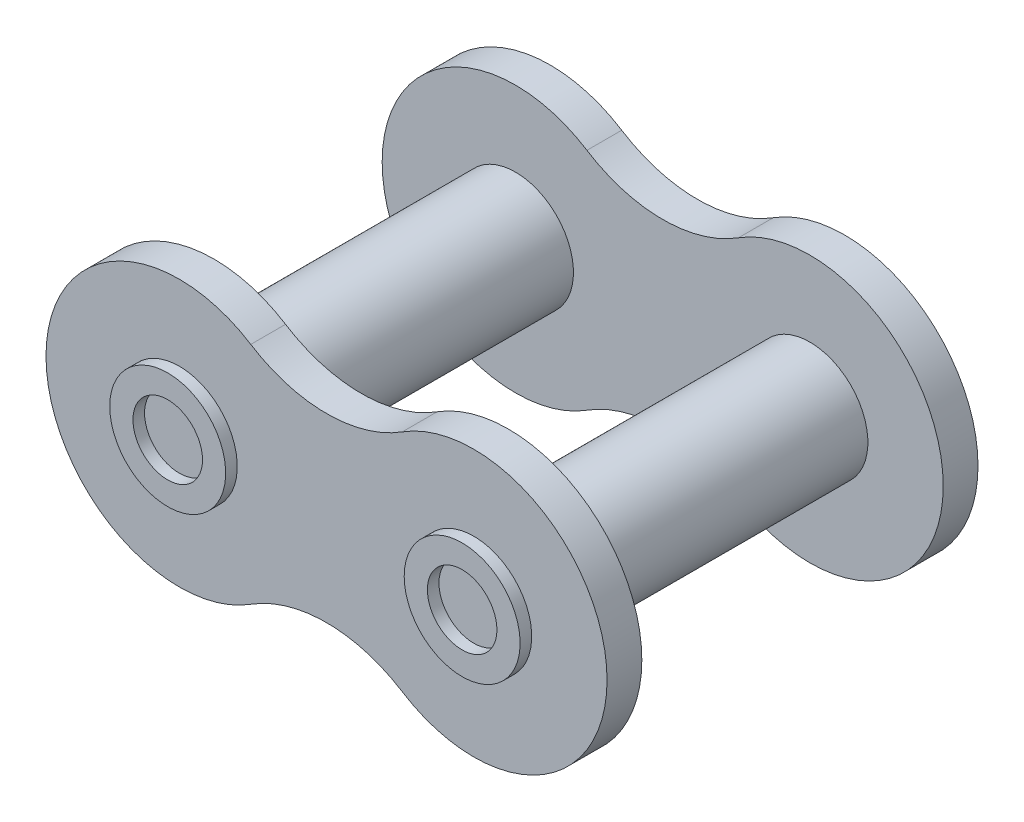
ISO-10303-21;
HEADER;
FILE_DESCRIPTION(('STEP AP214'),'2;1');
FILE_NAME('part.step','',(''),(''),'','','');
FILE_SCHEMA(('AUTOMOTIVE_DESIGN { 1 0 10303 214 1 1 1 1 }'));
ENDSEC;
DATA;
#1=APPLICATION_CONTEXT('core data for automotive mechanical design processes');
#2=APPLICATION_PROTOCOL_DEFINITION('international standard','automotive_design',2000,#1);
#3=PRODUCT_CONTEXT('',#1,'mechanical');
#4=PRODUCT('Part','Part','',(#3));
#5=PRODUCT_RELATED_PRODUCT_CATEGORY('part','',(#4));
#6=PRODUCT_DEFINITION_FORMATION('','',#4);
#7=PRODUCT_DEFINITION_CONTEXT('part definition',#1,'design');
#8=PRODUCT_DEFINITION('design','',#6,#7);
#9=PRODUCT_DEFINITION_SHAPE('','',#8);
#10=(LENGTH_UNIT() NAMED_UNIT(*) SI_UNIT(.MILLI.,.METRE.));
#11=(NAMED_UNIT(*) PLANE_ANGLE_UNIT() SI_UNIT($,.RADIAN.));
#12=(NAMED_UNIT(*) SI_UNIT($,.STERADIAN.) SOLID_ANGLE_UNIT());
#13=UNCERTAINTY_MEASURE_WITH_UNIT(LENGTH_MEASURE(1.E-05),#10,'distance_accuracy_value','');
#14=(GEOMETRIC_REPRESENTATION_CONTEXT(3) GLOBAL_UNCERTAINTY_ASSIGNED_CONTEXT((#13)) GLOBAL_UNIT_ASSIGNED_CONTEXT((#10,
#11,#12)) REPRESENTATION_CONTEXT('',''));
#15=CARTESIAN_POINT('',(0.,0.,0.));
#16=DIRECTION('',(0.,0.,1.));
#17=DIRECTION('',(1.,0.,0.));
#18=AXIS2_PLACEMENT_3D('',#15,#16,#17);
#19=CARTESIAN_POINT('',(3.175,5.,-8.));
#20=DIRECTION('',(0.,0.,1.));
#21=DIRECTION('',(1.,0.,0.));
#22=AXIS2_PLACEMENT_3D('',#19,#20,#21);
#23=PLANE('',#22);
#24=CARTESIAN_POINT('',(6.35,0.,-8.));
#25=DIRECTION('',(0.,0.,1.));
#26=DIRECTION('',(1.,0.,0.));
#27=AXIS2_PLACEMENT_3D('',#24,#25,#26);
#28=CIRCLE('',#27,2.5);
#29=CARTESIAN_POINT('',(8.85,0.,-8.));
#30=VERTEX_POINT('',#29);
#31=EDGE_CURVE('E272',#30,#30,#28,.T.);
#32=ORIENTED_EDGE('',*,*,#31,.T.);
#33=EDGE_LOOP('',(#32));
#34=FACE_BOUND('',#33,.T.);
#35=CARTESIAN_POINT('',(0.,10.,-8.));
#36=DIRECTION('',(0.,0.,1.));
#37=DIRECTION('',(1.,0.,0.));
#38=AXIS2_PLACEMENT_3D('',#35,#36,#37);
#39=CIRCLE('',#38,6.09577983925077);
#40=CARTESIAN_POINT('',(-3.26767865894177,4.85404935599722,-8.));
#41=VERTEX_POINT('',#40);
#42=CARTESIAN_POINT('',(3.26767865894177,4.85404935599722,-8.));
#43=VERTEX_POINT('',#42);
#44=EDGE_CURVE('E166',#41,#43,#39,.T.);
#45=ORIENTED_EDGE('',*,*,#44,.T.);
#46=CARTESIAN_POINT('',(6.35,0.,-8.));
#47=DIRECTION('',(0.,0.,-1.));
#48=DIRECTION('',(-1.,0.,0.));
#49=AXIS2_PLACEMENT_3D('',#46,#47,#48);
#50=CIRCLE('',#49,5.75);
#51=CARTESIAN_POINT('',(3.26767865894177,-4.85404935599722,-8.));
#52=VERTEX_POINT('',#51);
#53=EDGE_CURVE('E84',#43,#52,#50,.T.);
#54=ORIENTED_EDGE('',*,*,#53,.T.);
#55=CARTESIAN_POINT('',(0.,-10.,-8.));
#56=DIRECTION('',(0.,0.,-1.));
#57=DIRECTION('',(-1.,0.,0.));
#58=AXIS2_PLACEMENT_3D('',#55,#56,#57);
#59=CIRCLE('',#58,6.09577983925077);
#60=CARTESIAN_POINT('',(-3.26767865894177,-4.85404935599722,-8.));
#61=VERTEX_POINT('',#60);
#62=EDGE_CURVE('E170',#61,#52,#59,.T.);
#63=ORIENTED_EDGE('',*,*,#62,.F.);
#64=CARTESIAN_POINT('',(-6.35,0.,-8.));
#65=DIRECTION('',(0.,0.,1.));
#66=DIRECTION('',(1.,0.,0.));
#67=AXIS2_PLACEMENT_3D('',#64,#65,#66);
#68=CIRCLE('',#67,5.75);
#69=EDGE_CURVE('E173',#41,#61,#68,.T.);
#70=ORIENTED_EDGE('',*,*,#69,.F.);
#71=EDGE_LOOP('',(#45,#54,#63,#70));
#72=FACE_BOUND('',#71,.T.);
#73=CARTESIAN_POINT('',(-6.35,0.,-8.));
#74=DIRECTION('',(0.,0.,1.));
#75=DIRECTION('',(1.,0.,0.));
#76=AXIS2_PLACEMENT_3D('',#73,#74,#75);
#77=CIRCLE('',#76,2.5);
#78=CARTESIAN_POINT('',(-3.85,0.,-8.));
#79=VERTEX_POINT('',#78);
#80=EDGE_CURVE('E12',#79,#79,#77,.F.);
#81=ORIENTED_EDGE('',*,*,#80,.F.);
#82=EDGE_LOOP('',(#81));
#83=FACE_BOUND('',#82,.T.);
#84=ADVANCED_FACE('F39',(#34,#72,#83),#23,.F.);
#85=CARTESIAN_POINT('',(3.175,5.,8.));
#86=DIRECTION('',(0.,0.,-1.));
#87=DIRECTION('',(1.,0.,0.));
#88=AXIS2_PLACEMENT_3D('',#85,#86,#87);
#89=PLANE('',#88);
#90=CARTESIAN_POINT('',(6.35,0.,8.));
#91=DIRECTION('',(0.,0.,-1.));
#92=DIRECTION('',(-1.,0.,0.));
#93=AXIS2_PLACEMENT_3D('',#90,#91,#92);
#94=CIRCLE('',#93,2.5);
#95=CARTESIAN_POINT('',(3.85,0.,8.));
#96=VERTEX_POINT('',#95);
#97=EDGE_CURVE('E276',#96,#96,#94,.T.);
#98=ORIENTED_EDGE('',*,*,#97,.T.);
#99=EDGE_LOOP('',(#98));
#100=FACE_BOUND('',#99,.T.);
#101=CARTESIAN_POINT('',(0.,10.,8.));
#102=DIRECTION('',(0.,0.,1.));
#103=DIRECTION('',(1.,0.,0.));
#104=AXIS2_PLACEMENT_3D('',#101,#102,#103);
#105=CIRCLE('',#104,6.09577983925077);
#106=CARTESIAN_POINT('',(-3.26767865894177,4.85404935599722,8.));
#107=VERTEX_POINT('',#106);
#108=CARTESIAN_POINT('',(3.26767865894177,4.85404935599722,8.));
#109=VERTEX_POINT('',#108);
#110=EDGE_CURVE('E116',#107,#109,#105,.T.);
#111=ORIENTED_EDGE('',*,*,#110,.F.);
#112=CARTESIAN_POINT('',(-6.35,0.,8.));
#113=DIRECTION('',(0.,0.,1.));
#114=DIRECTION('',(1.,0.,0.));
#115=AXIS2_PLACEMENT_3D('',#112,#113,#114);
#116=CIRCLE('',#115,5.75);
#117=CARTESIAN_POINT('',(-3.26767865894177,-4.85404935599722,8.));
#118=VERTEX_POINT('',#117);
#119=EDGE_CURVE('E126',#107,#118,#116,.T.);
#120=ORIENTED_EDGE('',*,*,#119,.T.);
#121=CARTESIAN_POINT('',(0.,-10.,8.));
#122=DIRECTION('',(0.,0.,-1.));
#123=DIRECTION('',(-1.,0.,0.));
#124=AXIS2_PLACEMENT_3D('',#121,#122,#123);
#125=CIRCLE('',#124,6.09577983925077);
#126=CARTESIAN_POINT('',(3.26767865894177,-4.85404935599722,8.));
#127=VERTEX_POINT('',#126);
#128=EDGE_CURVE('E131',#118,#127,#125,.T.);
#129=ORIENTED_EDGE('',*,*,#128,.T.);
#130=CARTESIAN_POINT('',(6.35,0.,8.));
#131=DIRECTION('',(0.,0.,-1.));
#132=DIRECTION('',(-1.,0.,0.));
#133=AXIS2_PLACEMENT_3D('',#130,#131,#132);
#134=CIRCLE('',#133,5.75);
#135=EDGE_CURVE('E136',#109,#127,#134,.T.);
#136=ORIENTED_EDGE('',*,*,#135,.F.);
#137=EDGE_LOOP('',(#111,#120,#129,#136));
#138=FACE_BOUND('',#137,.T.);
#139=CARTESIAN_POINT('',(-6.35,0.,8.));
#140=DIRECTION('',(0.,0.,-1.));
#141=DIRECTION('',(-1.,0.,0.));
#142=AXIS2_PLACEMENT_3D('',#139,#140,#141);
#143=CIRCLE('',#142,2.5);
#144=CARTESIAN_POINT('',(-8.85,0.,8.));
#145=VERTEX_POINT('',#144);
#146=EDGE_CURVE('E43',#145,#145,#143,.F.);
#147=ORIENTED_EDGE('',*,*,#146,.F.);
#148=EDGE_LOOP('',(#147));
#149=FACE_BOUND('',#148,.T.);
#150=ADVANCED_FACE('F133',(#100,#138,#149),#89,.F.);
#151=CARTESIAN_POINT('',(3.175,5.,-6.5));
#152=DIRECTION('',(0.,0.,1.));
#153=DIRECTION('',(1.,0.,0.));
#154=AXIS2_PLACEMENT_3D('',#151,#152,#153);
#155=PLANE('',#154);
#156=CARTESIAN_POINT('',(0.,10.,-6.5));
#157=DIRECTION('',(0.,0.,1.));
#158=DIRECTION('',(1.,0.,0.));
#159=AXIS2_PLACEMENT_3D('',#156,#157,#158);
#160=CIRCLE('',#159,6.09577983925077);
#161=CARTESIAN_POINT('',(-3.26767865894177,4.85404935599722,-6.5));
#162=VERTEX_POINT('',#161);
#163=CARTESIAN_POINT('',(3.26767865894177,4.85404935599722,-6.5));
#164=VERTEX_POINT('',#163);
#165=EDGE_CURVE('E163',#162,#164,#160,.T.);
#166=ORIENTED_EDGE('',*,*,#165,.F.);
#167=CARTESIAN_POINT('',(-6.35,0.,-6.5));
#168=DIRECTION('',(0.,0.,1.));
#169=DIRECTION('',(1.,0.,0.));
#170=AXIS2_PLACEMENT_3D('',#167,#168,#169);
#171=CIRCLE('',#170,5.75);
#172=CARTESIAN_POINT('',(-3.26767865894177,-4.85404935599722,-6.5));
#173=VERTEX_POINT('',#172);
#174=EDGE_CURVE('E168',#162,#173,#171,.T.);
#175=ORIENTED_EDGE('',*,*,#174,.T.);
#176=CARTESIAN_POINT('',(0.,-10.,-6.5));
#177=DIRECTION('',(0.,0.,-1.));
#178=DIRECTION('',(-1.,0.,0.));
#179=AXIS2_PLACEMENT_3D('',#176,#177,#178);
#180=CIRCLE('',#179,6.09577983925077);
#181=CARTESIAN_POINT('',(3.26767865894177,-4.85404935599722,-6.5));
#182=VERTEX_POINT('',#181);
#183=EDGE_CURVE('E179',#173,#182,#180,.T.);
#184=ORIENTED_EDGE('',*,*,#183,.T.);
#185=CARTESIAN_POINT('',(6.35,0.,-6.5));
#186=DIRECTION('',(0.,0.,-1.));
#187=DIRECTION('',(-1.,0.,0.));
#188=AXIS2_PLACEMENT_3D('',#185,#186,#187);
#189=CIRCLE('',#188,5.75);
#190=EDGE_CURVE('E176',#164,#182,#189,.T.);
#191=ORIENTED_EDGE('',*,*,#190,.F.);
#192=EDGE_LOOP('',(#166,#175,#184,#191));
#193=FACE_BOUND('',#192,.T.);
#194=CARTESIAN_POINT('',(6.35,0.,-6.5));
#195=DIRECTION('',(0.,0.,1.));
#196=DIRECTION('',(1.,0.,0.));
#197=AXIS2_PLACEMENT_3D('',#194,#195,#196);
#198=CIRCLE('',#197,2.5);
#199=CARTESIAN_POINT('',(3.85,0.,-6.5));
#200=VERTEX_POINT('',#199);
#201=EDGE_CURVE('E189',#200,#200,#198,.F.);
#202=ORIENTED_EDGE('',*,*,#201,.T.);
#203=EDGE_LOOP('',(#202));
#204=FACE_BOUND('',#203,.T.);
#205=CARTESIAN_POINT('',(-6.35,0.,-6.5));
#206=DIRECTION('',(0.,0.,1.));
#207=DIRECTION('',(1.,0.,0.));
#208=AXIS2_PLACEMENT_3D('',#205,#206,#207);
#209=CIRCLE('',#208,2.5);
#210=CARTESIAN_POINT('',(-8.85,0.,-6.5));
#211=VERTEX_POINT('',#210);
#212=EDGE_CURVE('E160',#211,#211,#209,.T.);
#213=ORIENTED_EDGE('',*,*,#212,.F.);
#214=EDGE_LOOP('',(#213));
#215=FACE_BOUND('',#214,.T.);
#216=ADVANCED_FACE('F198',(#193,#204,#215),#155,.T.);
#217=CARTESIAN_POINT('',(6.35,0.,6.5));
#218=DIRECTION('',(0.,0.,-1.));
#219=DIRECTION('',(-1.,0.,0.));
#220=AXIS2_PLACEMENT_3D('',#217,#218,#219);
#221=CYLINDRICAL_SURFACE('',#220,2.5);
#222=CARTESIAN_POINT('',(6.35,0.,6.5));
#223=DIRECTION('',(0.,0.,-1.));
#224=DIRECTION('',(-1.,0.,0.));
#225=AXIS2_PLACEMENT_3D('',#222,#223,#224);
#226=CIRCLE('',#225,2.5);
#227=CARTESIAN_POINT('',(3.85,0.,6.5));
#228=VERTEX_POINT('',#227);
#229=EDGE_CURVE('E122',#228,#228,#226,.F.);
#230=CARTESIAN_POINT('',(3.85,0.,6.5));
#231=CARTESIAN_POINT('',(3.85,0.,6.36458333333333));
#232=CARTESIAN_POINT('',(3.85,0.,6.22916666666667));
#233=CARTESIAN_POINT('',(3.85,0.,5.95833333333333));
#234=CARTESIAN_POINT('',(3.85,0.,5.82291666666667));
#235=CARTESIAN_POINT('',(3.85,0.,5.55208333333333));
#236=CARTESIAN_POINT('',(3.85,0.,5.41666666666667));
#237=CARTESIAN_POINT('',(3.85,0.,5.14583333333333));
#238=CARTESIAN_POINT('',(3.85,0.,5.01041666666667));
#239=CARTESIAN_POINT('',(3.85,0.,4.73958333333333));
#240=CARTESIAN_POINT('',(3.85,0.,4.60416666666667));
#241=CARTESIAN_POINT('',(3.85,0.,4.33333333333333));
#242=CARTESIAN_POINT('',(3.85,0.,4.19791666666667));
#243=CARTESIAN_POINT('',(3.85,0.,3.92708333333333));
#244=CARTESIAN_POINT('',(3.85,0.,3.79166666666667));
#245=CARTESIAN_POINT('',(3.85,0.,3.52083333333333));
#246=CARTESIAN_POINT('',(3.85,0.,3.38541666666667));
#247=CARTESIAN_POINT('',(3.85,0.,3.11458333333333));
#248=CARTESIAN_POINT('',(3.85,0.,2.97916666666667));
#249=CARTESIAN_POINT('',(3.85,0.,2.70833333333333));
#250=CARTESIAN_POINT('',(3.85,0.,2.57291666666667));
#251=CARTESIAN_POINT('',(3.85,0.,2.30208333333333));
#252=CARTESIAN_POINT('',(3.85,0.,2.16666666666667));
#253=CARTESIAN_POINT('',(3.85,0.,1.89583333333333));
#254=CARTESIAN_POINT('',(3.85,0.,1.76041666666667));
#255=CARTESIAN_POINT('',(3.85,0.,1.48958333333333));
#256=CARTESIAN_POINT('',(3.85,0.,1.35416666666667));
#257=CARTESIAN_POINT('',(3.85,0.,1.08333333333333));
#258=CARTESIAN_POINT('',(3.85,0.,0.947916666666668));
#259=CARTESIAN_POINT('',(3.85,0.,0.677083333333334));
#260=CARTESIAN_POINT('',(3.85,0.,0.541666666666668));
#261=CARTESIAN_POINT('',(3.85,0.,0.270833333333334));
#262=CARTESIAN_POINT('',(3.85,0.,0.135416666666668));
#263=CARTESIAN_POINT('',(3.85,0.,-0.135416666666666));
#264=CARTESIAN_POINT('',(3.85,0.,-0.270833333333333));
#265=CARTESIAN_POINT('',(3.85,0.,-0.541666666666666));
#266=CARTESIAN_POINT('',(3.85,0.,-0.677083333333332));
#267=CARTESIAN_POINT('',(3.85,0.,-0.947916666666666));
#268=CARTESIAN_POINT('',(3.85,0.,-1.08333333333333));
#269=CARTESIAN_POINT('',(3.85,0.,-1.35416666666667));
#270=CARTESIAN_POINT('',(3.85,0.,-1.48958333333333));
#271=CARTESIAN_POINT('',(3.85,0.,-1.76041666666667));
#272=CARTESIAN_POINT('',(3.85,0.,-1.89583333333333));
#273=CARTESIAN_POINT('',(3.85,0.,-2.16666666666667));
#274=CARTESIAN_POINT('',(3.85,0.,-2.30208333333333));
#275=CARTESIAN_POINT('',(3.85,0.,-2.57291666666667));
#276=CARTESIAN_POINT('',(3.85,0.,-2.70833333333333));
#277=CARTESIAN_POINT('',(3.85,0.,-2.97916666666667));
#278=CARTESIAN_POINT('',(3.85,0.,-3.11458333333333));
#279=CARTESIAN_POINT('',(3.85,0.,-3.38541666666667));
#280=CARTESIAN_POINT('',(3.85,0.,-3.52083333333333));
#281=CARTESIAN_POINT('',(3.85,0.,-3.79166666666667));
#282=CARTESIAN_POINT('',(3.85,0.,-3.92708333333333));
#283=CARTESIAN_POINT('',(3.85,0.,-4.19791666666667));
#284=CARTESIAN_POINT('',(3.85,0.,-4.33333333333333));
#285=CARTESIAN_POINT('',(3.85,0.,-4.60416666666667));
#286=CARTESIAN_POINT('',(3.85,0.,-4.73958333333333));
#287=CARTESIAN_POINT('',(3.85,0.,-5.01041666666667));
#288=CARTESIAN_POINT('',(3.85,0.,-5.14583333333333));
#289=CARTESIAN_POINT('',(3.85,0.,-5.41666666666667));
#290=CARTESIAN_POINT('',(3.85,0.,-5.55208333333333));
#291=CARTESIAN_POINT('',(3.85,0.,-5.82291666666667));
#292=CARTESIAN_POINT('',(3.85,0.,-5.95833333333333));
#293=CARTESIAN_POINT('',(3.85,0.,-6.22916666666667));
#294=CARTESIAN_POINT('',(3.85,0.,-6.36458333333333));
#295=CARTESIAN_POINT('',(3.85,0.,-6.5));
#296=B_SPLINE_CURVE_WITH_KNOTS('',3,(#230,#231,#232,#233,#234,#235,#236,#237,#238,#239,#240,
#241,#242,#243,#244,#245,#246,#247,#248,#249,#250,#251,#252,#253,#254,#255,#256,#257,#258,#259,
#260,#261,#262,#263,#264,#265,#266,#267,#268,#269,#270,#271,#272,#273,#274,#275,#276,#277,#278,
#279,#280,#281,#282,#283,#284,#285,#286,#287,#288,#289,#290,#291,#292,#293,#294,#295),
.UNSPECIFIED.,.F.,.F.,(4,2,2,2,2,2,2,2,2,2,2,2,2,2,2,2,2,2,2,2,2,2,2,2,2,2,2,2,2,2,2,2,4),(0.,
0.40625,0.812500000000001,1.21875,1.625,2.03125,2.4375,2.84375,3.25,3.65625,4.0625,4.46875,
4.875,5.28125,5.6875,6.09375,6.5,6.90625,7.3125,7.71875,8.125,8.53125,8.9375,9.34375,9.75,
10.15625,10.5625,10.96875,11.375,11.78125,12.1875,12.59375,13.),.UNSPECIFIED.);
#297=EDGE_CURVE('BSEAM41',#228,#200,#296,.T.);
#298=ORIENTED_EDGE('',*,*,#229,.F.);
#299=ORIENTED_EDGE('',*,*,#201,.F.);
#300=ORIENTED_EDGE('',*,*,#297,.T.);
#301=ORIENTED_EDGE('',*,*,#297,.F.);
#302=EDGE_LOOP('',(#298,#300,#299,#301));
#303=FACE_BOUND('',#302,.T.);
#304=ADVANCED_FACE('F41',(#303),#221,.T.);
#305=CARTESIAN_POINT('',(0.,10.,-8.));
#306=DIRECTION('',(0.,0.,1.));
#307=DIRECTION('',(1.,0.,0.));
#308=AXIS2_PLACEMENT_3D('',#305,#306,#307);
#309=CYLINDRICAL_SURFACE('',#308,6.09577983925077);
#310=ORIENTED_EDGE('',*,*,#165,.T.);
#311=DIRECTION('',(0.,0.,1.));
#312=VECTOR('',#311,1.);
#313=CARTESIAN_POINT('',(3.26767865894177,4.85404935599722,-8.));
#314=LINE('',#313,#312);
#315=EDGE_CURVE('E188',#43,#164,#314,.T.);
#316=ORIENTED_EDGE('',*,*,#315,.F.);
#317=ORIENTED_EDGE('',*,*,#44,.F.);
#318=DIRECTION('',(0.,0.,1.));
#319=VECTOR('',#318,1.);
#320=CARTESIAN_POINT('',(-3.26767865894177,4.85404935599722,-8.));
#321=LINE('',#320,#319);
#322=EDGE_CURVE('E57',#41,#162,#321,.T.);
#323=ORIENTED_EDGE('',*,*,#322,.T.);
#324=EDGE_LOOP('',(#310,#316,#317,#323));
#325=FACE_BOUND('',#324,.T.);
#326=ADVANCED_FACE('F244',(#325),#309,.F.);
#327=CARTESIAN_POINT('',(6.35,0.,-8.));
#328=DIRECTION('',(0.,0.,1.));
#329=DIRECTION('',(1.,0.,0.));
#330=AXIS2_PLACEMENT_3D('',#327,#328,#329);
#331=CYLINDRICAL_SURFACE('',#330,5.75);
#332=ORIENTED_EDGE('',*,*,#190,.T.);
#333=DIRECTION('',(0.,0.,1.));
#334=VECTOR('',#333,1.);
#335=CARTESIAN_POINT('',(3.26767865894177,-4.85404935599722,-8.));
#336=LINE('',#335,#334);
#337=EDGE_CURVE('E186',#52,#182,#336,.T.);
#338=ORIENTED_EDGE('',*,*,#337,.F.);
#339=ORIENTED_EDGE('',*,*,#53,.F.);
#340=ORIENTED_EDGE('',*,*,#315,.T.);
#341=EDGE_LOOP('',(#332,#338,#339,#340));
#342=FACE_BOUND('',#341,.T.);
#343=ADVANCED_FACE('F241',(#342),#331,.T.);
#344=CARTESIAN_POINT('',(0.,-10.,-8.));
#345=DIRECTION('',(0.,0.,1.));
#346=DIRECTION('',(1.,0.,0.));
#347=AXIS2_PLACEMENT_3D('',#344,#345,#346);
#348=CYLINDRICAL_SURFACE('',#347,6.09577983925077);
#349=ORIENTED_EDGE('',*,*,#183,.F.);
#350=DIRECTION('',(0.,0.,1.));
#351=VECTOR('',#350,1.);
#352=CARTESIAN_POINT('',(-3.26767865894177,-4.85404935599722,-8.));
#353=LINE('',#352,#351);
#354=EDGE_CURVE('E72',#61,#173,#353,.T.);
#355=ORIENTED_EDGE('',*,*,#354,.F.);
#356=ORIENTED_EDGE('',*,*,#62,.T.);
#357=ORIENTED_EDGE('',*,*,#337,.T.);
#358=EDGE_LOOP('',(#349,#355,#356,#357));
#359=FACE_BOUND('',#358,.T.);
#360=ADVANCED_FACE('F238',(#359),#348,.F.);
#361=CARTESIAN_POINT('',(-6.35,0.,-8.));
#362=DIRECTION('',(0.,0.,1.));
#363=DIRECTION('',(1.,0.,0.));
#364=AXIS2_PLACEMENT_3D('',#361,#362,#363);
#365=CYLINDRICAL_SURFACE('',#364,5.75);
#366=ORIENTED_EDGE('',*,*,#174,.F.);
#367=ORIENTED_EDGE('',*,*,#322,.F.);
#368=ORIENTED_EDGE('',*,*,#69,.T.);
#369=ORIENTED_EDGE('',*,*,#354,.T.);
#370=EDGE_LOOP('',(#366,#367,#368,#369));
#371=FACE_BOUND('',#370,.T.);
#372=ADVANCED_FACE('F233',(#371),#365,.T.);
#373=CARTESIAN_POINT('',(-6.35,0.,6.5));
#374=DIRECTION('',(0.,0.,-1.));
#375=DIRECTION('',(-1.,0.,0.));
#376=AXIS2_PLACEMENT_3D('',#373,#374,#375);
#377=CYLINDRICAL_SURFACE('',#376,2.5);
#378=CARTESIAN_POINT('',(-6.35,0.,6.5));
#379=DIRECTION('',(0.,0.,1.));
#380=DIRECTION('',(1.,0.,0.));
#381=AXIS2_PLACEMENT_3D('',#378,#379,#380);
#382=CIRCLE('',#381,2.5);
#383=CARTESIAN_POINT('',(-8.85,0.,6.5));
#384=VERTEX_POINT('',#383);
#385=EDGE_CURVE('E159',#384,#384,#382,.T.);
#386=CARTESIAN_POINT('',(-8.85,0.,6.5));
#387=CARTESIAN_POINT('',(-8.85,0.,6.36458333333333));
#388=CARTESIAN_POINT('',(-8.85,0.,6.22916666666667));
#389=CARTESIAN_POINT('',(-8.85,0.,5.95833333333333));
#390=CARTESIAN_POINT('',(-8.85,0.,5.82291666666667));
#391=CARTESIAN_POINT('',(-8.85,0.,5.55208333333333));
#392=CARTESIAN_POINT('',(-8.85,0.,5.41666666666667));
#393=CARTESIAN_POINT('',(-8.85,0.,5.14583333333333));
#394=CARTESIAN_POINT('',(-8.85,0.,5.01041666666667));
#395=CARTESIAN_POINT('',(-8.85,0.,4.73958333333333));
#396=CARTESIAN_POINT('',(-8.85,0.,4.60416666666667));
#397=CARTESIAN_POINT('',(-8.85,0.,4.33333333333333));
#398=CARTESIAN_POINT('',(-8.85,0.,4.19791666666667));
#399=CARTESIAN_POINT('',(-8.85,0.,3.92708333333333));
#400=CARTESIAN_POINT('',(-8.85,0.,3.79166666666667));
#401=CARTESIAN_POINT('',(-8.85,0.,3.52083333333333));
#402=CARTESIAN_POINT('',(-8.85,0.,3.38541666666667));
#403=CARTESIAN_POINT('',(-8.85,0.,3.11458333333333));
#404=CARTESIAN_POINT('',(-8.85,0.,2.97916666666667));
#405=CARTESIAN_POINT('',(-8.85,0.,2.70833333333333));
#406=CARTESIAN_POINT('',(-8.85,0.,2.57291666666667));
#407=CARTESIAN_POINT('',(-8.85,0.,2.30208333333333));
#408=CARTESIAN_POINT('',(-8.85,0.,2.16666666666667));
#409=CARTESIAN_POINT('',(-8.85,0.,1.89583333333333));
#410=CARTESIAN_POINT('',(-8.85,0.,1.76041666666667));
#411=CARTESIAN_POINT('',(-8.85,0.,1.48958333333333));
#412=CARTESIAN_POINT('',(-8.85,0.,1.35416666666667));
#413=CARTESIAN_POINT('',(-8.85,0.,1.08333333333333));
#414=CARTESIAN_POINT('',(-8.85,0.,0.947916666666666));
#415=CARTESIAN_POINT('',(-8.85,0.,0.677083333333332));
#416=CARTESIAN_POINT('',(-8.85,0.,0.541666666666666));
#417=CARTESIAN_POINT('',(-8.85,0.,0.270833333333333));
#418=CARTESIAN_POINT('',(-8.85,0.,0.135416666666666));
#419=CARTESIAN_POINT('',(-8.85,0.,-0.135416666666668));
#420=CARTESIAN_POINT('',(-8.85,0.,-0.270833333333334));
#421=CARTESIAN_POINT('',(-8.85,0.,-0.541666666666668));
#422=CARTESIAN_POINT('',(-8.85,0.,-0.677083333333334));
#423=CARTESIAN_POINT('',(-8.85,0.,-0.947916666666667));
#424=CARTESIAN_POINT('',(-8.85,0.,-1.08333333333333));
#425=CARTESIAN_POINT('',(-8.85,0.,-1.35416666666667));
#426=CARTESIAN_POINT('',(-8.85,0.,-1.48958333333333));
#427=CARTESIAN_POINT('',(-8.85,0.,-1.76041666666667));
#428=CARTESIAN_POINT('',(-8.85,0.,-1.89583333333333));
#429=CARTESIAN_POINT('',(-8.85,0.,-2.16666666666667));
#430=CARTESIAN_POINT('',(-8.85,0.,-2.30208333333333));
#431=CARTESIAN_POINT('',(-8.85,0.,-2.57291666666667));
#432=CARTESIAN_POINT('',(-8.85,0.,-2.70833333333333));
#433=CARTESIAN_POINT('',(-8.85,0.,-2.97916666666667));
#434=CARTESIAN_POINT('',(-8.85,0.,-3.11458333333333));
#435=CARTESIAN_POINT('',(-8.85,0.,-3.38541666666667));
#436=CARTESIAN_POINT('',(-8.85,0.,-3.52083333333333));
#437=CARTESIAN_POINT('',(-8.85,0.,-3.79166666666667));
#438=CARTESIAN_POINT('',(-8.85,0.,-3.92708333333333));
#439=CARTESIAN_POINT('',(-8.85,0.,-4.19791666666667));
#440=CARTESIAN_POINT('',(-8.85,0.,-4.33333333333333));
#441=CARTESIAN_POINT('',(-8.85,0.,-4.60416666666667));
#442=CARTESIAN_POINT('',(-8.85,0.,-4.73958333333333));
#443=CARTESIAN_POINT('',(-8.85,0.,-5.01041666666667));
#444=CARTESIAN_POINT('',(-8.85,0.,-5.14583333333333));
#445=CARTESIAN_POINT('',(-8.85,0.,-5.41666666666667));
#446=CARTESIAN_POINT('',(-8.85,0.,-5.55208333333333));
#447=CARTESIAN_POINT('',(-8.85,0.,-5.82291666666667));
#448=CARTESIAN_POINT('',(-8.85,0.,-5.95833333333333));
#449=CARTESIAN_POINT('',(-8.85,0.,-6.22916666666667));
#450=CARTESIAN_POINT('',(-8.85,0.,-6.36458333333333));
#451=CARTESIAN_POINT('',(-8.85,0.,-6.5));
#452=B_SPLINE_CURVE_WITH_KNOTS('',3,(#386,#387,#388,#389,#390,#391,#392,#393,#394,#395,#396,
#397,#398,#399,#400,#401,#402,#403,#404,#405,#406,#407,#408,#409,#410,#411,#412,#413,#414,#415,
#416,#417,#418,#419,#420,#421,#422,#423,#424,#425,#426,#427,#428,#429,#430,#431,#432,#433,#434,
#435,#436,#437,#438,#439,#440,#441,#442,#443,#444,#445,#446,#447,#448,#449,#450,#451),
.UNSPECIFIED.,.F.,.F.,(4,2,2,2,2,2,2,2,2,2,2,2,2,2,2,2,2,2,2,2,2,2,2,2,2,2,2,2,2,2,2,2,4),(0.,
0.40625,0.8125,1.21875,1.625,2.03125,2.4375,2.84375,3.25,3.65625,4.0625,4.46875,4.875,5.28125,
5.6875,6.09375,6.5,6.90625,7.3125,7.71875,8.125,8.53125,8.9375,9.34375,9.75,10.15625,10.5625,
10.96875,11.375,11.78125,12.1875,12.59375,13.),.UNSPECIFIED.);
#453=EDGE_CURVE('BSEAM217',#384,#211,#452,.T.);
#454=ORIENTED_EDGE('',*,*,#385,.F.);
#455=ORIENTED_EDGE('',*,*,#212,.T.);
#456=ORIENTED_EDGE('',*,*,#453,.T.);
#457=ORIENTED_EDGE('',*,*,#453,.F.);
#458=EDGE_LOOP('',(#454,#456,#455,#457));
#459=FACE_BOUND('',#458,.T.);
#460=ADVANCED_FACE('F217',(#459),#377,.T.);
#461=CARTESIAN_POINT('',(3.175,5.,6.5));
#462=DIRECTION('',(0.,0.,-1.));
#463=DIRECTION('',(1.,0.,0.));
#464=AXIS2_PLACEMENT_3D('',#461,#462,#463);
#465=PLANE('',#464);
#466=ORIENTED_EDGE('',*,*,#229,.T.);
#467=EDGE_LOOP('',(#466));
#468=FACE_BOUND('',#467,.T.);
#469=CARTESIAN_POINT('',(0.,10.,6.5));
#470=DIRECTION('',(0.,0.,1.));
#471=DIRECTION('',(1.,0.,0.));
#472=AXIS2_PLACEMENT_3D('',#469,#470,#471);
#473=CIRCLE('',#472,6.09577983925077);
#474=CARTESIAN_POINT('',(-3.26767865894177,4.85404935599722,6.5));
#475=VERTEX_POINT('',#474);
#476=CARTESIAN_POINT('',(3.26767865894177,4.85404935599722,6.5));
#477=VERTEX_POINT('',#476);
#478=EDGE_CURVE('E119',#475,#477,#473,.T.);
#479=ORIENTED_EDGE('',*,*,#478,.T.);
#480=CARTESIAN_POINT('',(6.35,0.,6.5));
#481=DIRECTION('',(0.,0.,-1.));
#482=DIRECTION('',(-1.,0.,0.));
#483=AXIS2_PLACEMENT_3D('',#480,#481,#482);
#484=CIRCLE('',#483,5.75);
#485=CARTESIAN_POINT('',(3.26767865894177,-4.85404935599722,6.5));
#486=VERTEX_POINT('',#485);
#487=EDGE_CURVE('E137',#477,#486,#484,.T.);
#488=ORIENTED_EDGE('',*,*,#487,.T.);
#489=CARTESIAN_POINT('',(0.,-10.,6.5));
#490=DIRECTION('',(0.,0.,-1.));
#491=DIRECTION('',(-1.,0.,0.));
#492=AXIS2_PLACEMENT_3D('',#489,#490,#491);
#493=CIRCLE('',#492,6.09577983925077);
#494=CARTESIAN_POINT('',(-3.26767865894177,-4.85404935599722,6.5));
#495=VERTEX_POINT('',#494);
#496=EDGE_CURVE('E140',#495,#486,#493,.T.);
#497=ORIENTED_EDGE('',*,*,#496,.F.);
#498=CARTESIAN_POINT('',(-6.35,0.,6.5));
#499=DIRECTION('',(0.,0.,1.));
#500=DIRECTION('',(1.,0.,0.));
#501=AXIS2_PLACEMENT_3D('',#498,#499,#500);
#502=CIRCLE('',#501,5.75);
#503=EDGE_CURVE('E148',#475,#495,#502,.T.);
#504=ORIENTED_EDGE('',*,*,#503,.F.);
#505=EDGE_LOOP('',(#479,#488,#497,#504));
#506=FACE_BOUND('',#505,.T.);
#507=ORIENTED_EDGE('',*,*,#385,.T.);
#508=EDGE_LOOP('',(#507));
#509=FACE_BOUND('',#508,.T.);
#510=ADVANCED_FACE('F214',(#468,#506,#509),#465,.T.);
#511=CARTESIAN_POINT('',(0.,10.,8.));
#512=DIRECTION('',(0.,0.,-1.));
#513=DIRECTION('',(-1.,0.,0.));
#514=AXIS2_PLACEMENT_3D('',#511,#512,#513);
#515=CYLINDRICAL_SURFACE('',#514,6.09577983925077);
#516=ORIENTED_EDGE('',*,*,#478,.F.);
#517=DIRECTION('',(0.,0.,-1.));
#518=VECTOR('',#517,1.);
#519=CARTESIAN_POINT('',(-3.26767865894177,4.85404935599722,8.));
#520=LINE('',#519,#518);
#521=EDGE_CURVE('E112',#107,#475,#520,.T.);
#522=ORIENTED_EDGE('',*,*,#521,.F.);
#523=ORIENTED_EDGE('',*,*,#110,.T.);
#524=DIRECTION('',(0.,0.,-1.));
#525=VECTOR('',#524,1.);
#526=CARTESIAN_POINT('',(3.26767865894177,4.85404935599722,8.));
#527=LINE('',#526,#525);
#528=EDGE_CURVE('E146',#109,#477,#527,.T.);
#529=ORIENTED_EDGE('',*,*,#528,.T.);
#530=EDGE_LOOP('',(#516,#522,#523,#529));
#531=FACE_BOUND('',#530,.T.);
#532=ADVANCED_FACE('F114',(#531),#515,.F.);
#533=CARTESIAN_POINT('',(-6.35,0.,8.));
#534=DIRECTION('',(0.,0.,-1.));
#535=DIRECTION('',(-1.,0.,0.));
#536=AXIS2_PLACEMENT_3D('',#533,#534,#535);
#537=CYLINDRICAL_SURFACE('',#536,5.75);
#538=ORIENTED_EDGE('',*,*,#503,.T.);
#539=DIRECTION('',(0.,0.,-1.));
#540=VECTOR('',#539,1.);
#541=CARTESIAN_POINT('',(-3.26767865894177,-4.85404935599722,8.));
#542=LINE('',#541,#540);
#543=EDGE_CURVE('E123',#118,#495,#542,.T.);
#544=ORIENTED_EDGE('',*,*,#543,.F.);
#545=ORIENTED_EDGE('',*,*,#119,.F.);
#546=ORIENTED_EDGE('',*,*,#521,.T.);
#547=EDGE_LOOP('',(#538,#544,#545,#546));
#548=FACE_BOUND('',#547,.T.);
#549=ADVANCED_FACE('F127',(#548),#537,.T.);
#550=CARTESIAN_POINT('',(0.,-10.,8.));
#551=DIRECTION('',(0.,0.,-1.));
#552=DIRECTION('',(-1.,0.,0.));
#553=AXIS2_PLACEMENT_3D('',#550,#551,#552);
#554=CYLINDRICAL_SURFACE('',#553,6.09577983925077);
#555=ORIENTED_EDGE('',*,*,#496,.T.);
#556=DIRECTION('',(0.,0.,-1.));
#557=VECTOR('',#556,1.);
#558=CARTESIAN_POINT('',(3.26767865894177,-4.85404935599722,8.));
#559=LINE('',#558,#557);
#560=EDGE_CURVE('E154',#127,#486,#559,.T.);
#561=ORIENTED_EDGE('',*,*,#560,.F.);
#562=ORIENTED_EDGE('',*,*,#128,.F.);
#563=ORIENTED_EDGE('',*,*,#543,.T.);
#564=EDGE_LOOP('',(#555,#561,#562,#563));
#565=FACE_BOUND('',#564,.T.);
#566=ADVANCED_FACE('F223',(#565),#554,.F.);
#567=CARTESIAN_POINT('',(6.35,0.,8.));
#568=DIRECTION('',(0.,0.,-1.));
#569=DIRECTION('',(-1.,0.,0.));
#570=AXIS2_PLACEMENT_3D('',#567,#568,#569);
#571=CYLINDRICAL_SURFACE('',#570,5.75);
#572=ORIENTED_EDGE('',*,*,#487,.F.);
#573=ORIENTED_EDGE('',*,*,#528,.F.);
#574=ORIENTED_EDGE('',*,*,#135,.T.);
#575=ORIENTED_EDGE('',*,*,#560,.T.);
#576=EDGE_LOOP('',(#572,#573,#574,#575));
#577=FACE_BOUND('',#576,.T.);
#578=ADVANCED_FACE('F219',(#577),#571,.T.);
#579=CARTESIAN_POINT('',(3.175,5.,8.5));
#580=DIRECTION('',(0.,0.,-1.));
#581=DIRECTION('',(1.,0.,0.));
#582=AXIS2_PLACEMENT_3D('',#579,#580,#581);
#583=PLANE('',#582);
#584=CARTESIAN_POINT('',(-6.35,0.,8.5));
#585=DIRECTION('',(0.,0.,1.));
#586=DIRECTION('',(1.,0.,0.));
#587=AXIS2_PLACEMENT_3D('',#584,#585,#586);
#588=CIRCLE('',#587,1.5);
#589=CARTESIAN_POINT('',(-4.85,0.,8.5));
#590=VERTEX_POINT('',#589);
#591=EDGE_CURVE('E289',#590,#590,#588,.T.);
#592=ORIENTED_EDGE('',*,*,#591,.F.);
#593=EDGE_LOOP('',(#592));
#594=FACE_BOUND('',#593,.T.);
#595=CARTESIAN_POINT('',(-6.35,0.,8.5));
#596=DIRECTION('',(0.,0.,-1.));
#597=DIRECTION('',(-1.,0.,0.));
#598=AXIS2_PLACEMENT_3D('',#595,#596,#597);
#599=CIRCLE('',#598,2.5);
#600=CARTESIAN_POINT('',(-8.85,0.,8.5));
#601=VERTEX_POINT('',#600);
#602=EDGE_CURVE('E149',#601,#601,#599,.T.);
#603=ORIENTED_EDGE('',*,*,#602,.F.);
#604=EDGE_LOOP('',(#603));
#605=FACE_BOUND('',#604,.T.);
#606=ADVANCED_FACE('F222',(#594,#605),#583,.F.);
#607=CARTESIAN_POINT('',(-6.35,0.,16.0710678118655));
#608=DIRECTION('',(0.,0.,-1.));
#609=DIRECTION('',(-1.,0.,0.));
#610=AXIS2_PLACEMENT_3D('',#607,#608,#609);
#611=CYLINDRICAL_SURFACE('',#610,2.5);
#612=ORIENTED_EDGE('',*,*,#602,.T.);
#613=EDGE_LOOP('',(#612));
#614=FACE_BOUND('',#613,.T.);
#615=ORIENTED_EDGE('',*,*,#146,.T.);
#616=EDGE_LOOP('',(#615));
#617=FACE_BOUND('',#616,.T.);
#618=ADVANCED_FACE('F196',(#614,#617),#611,.T.);
#619=CARTESIAN_POINT('',(-6.35,0.,-8.5));
#620=DIRECTION('',(0.,0.,1.));
#621=DIRECTION('',(1.,0.,0.));
#622=AXIS2_PLACEMENT_3D('',#619,#620,#621);
#623=CIRCLE('',#622,2.5);
#624=CARTESIAN_POINT('',(-3.85,0.,-8.5));
#625=VERTEX_POINT('',#624);
#626=EDGE_CURVE('E270',#625,#625,#623,.F.);
#627=ORIENTED_EDGE('',*,*,#626,.F.);
#628=EDGE_LOOP('',(#627));
#629=FACE_BOUND('',#628,.T.);
#630=ORIENTED_EDGE('',*,*,#80,.T.);
#631=EDGE_LOOP('',(#630));
#632=FACE_BOUND('',#631,.T.);
#633=ADVANCED_FACE('F212',(#629,#632),#611,.T.);
#634=CARTESIAN_POINT('',(3.175,5.,-8.5));
#635=DIRECTION('',(0.,0.,1.));
#636=DIRECTION('',(1.,0.,0.));
#637=AXIS2_PLACEMENT_3D('',#634,#635,#636);
#638=PLANE('',#637);
#639=CARTESIAN_POINT('',(-6.35,0.,-8.5));
#640=DIRECTION('',(0.,0.,-1.));
#641=DIRECTION('',(-1.,0.,0.));
#642=AXIS2_PLACEMENT_3D('',#639,#640,#641);
#643=CIRCLE('',#642,1.5);
#644=CARTESIAN_POINT('',(-7.85,0.,-8.5));
#645=VERTEX_POINT('',#644);
#646=EDGE_CURVE('E301',#645,#645,#643,.T.);
#647=ORIENTED_EDGE('',*,*,#646,.F.);
#648=EDGE_LOOP('',(#647));
#649=FACE_BOUND('',#648,.T.);
#650=ORIENTED_EDGE('',*,*,#626,.T.);
#651=EDGE_LOOP('',(#650));
#652=FACE_BOUND('',#651,.T.);
#653=ADVANCED_FACE('F258',(#649,#652),#638,.F.);
#654=CARTESIAN_POINT('',(3.175,5.,8.5));
#655=DIRECTION('',(0.,0.,-1.));
#656=DIRECTION('',(1.,0.,0.));
#657=AXIS2_PLACEMENT_3D('',#654,#655,#656);
#658=PLANE('',#657);
#659=CARTESIAN_POINT('',(6.35,0.,8.5));
#660=DIRECTION('',(0.,0.,1.));
#661=DIRECTION('',(1.,0.,0.));
#662=AXIS2_PLACEMENT_3D('',#659,#660,#661);
#663=CIRCLE('',#662,1.5);
#664=CARTESIAN_POINT('',(7.85,0.,8.5));
#665=VERTEX_POINT('',#664);
#666=EDGE_CURVE('E295',#665,#665,#663,.T.);
#667=ORIENTED_EDGE('',*,*,#666,.F.);
#668=EDGE_LOOP('',(#667));
#669=FACE_BOUND('',#668,.T.);
#670=CARTESIAN_POINT('',(6.35,0.,8.5));
#671=DIRECTION('',(0.,0.,-1.));
#672=DIRECTION('',(-1.,0.,0.));
#673=AXIS2_PLACEMENT_3D('',#670,#671,#672);
#674=CIRCLE('',#673,2.5);
#675=CARTESIAN_POINT('',(3.85,0.,8.5));
#676=VERTEX_POINT('',#675);
#677=EDGE_CURVE('E283',#676,#676,#674,.F.);
#678=ORIENTED_EDGE('',*,*,#677,.T.);
#679=EDGE_LOOP('',(#678));
#680=FACE_BOUND('',#679,.T.);
#681=ADVANCED_FACE('F264',(#669,#680),#658,.F.);
#682=CARTESIAN_POINT('',(6.35,0.,16.0710678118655));
#683=DIRECTION('',(0.,0.,-1.));
#684=DIRECTION('',(-1.,0.,0.));
#685=AXIS2_PLACEMENT_3D('',#682,#683,#684);
#686=CYLINDRICAL_SURFACE('',#685,2.5);
#687=ORIENTED_EDGE('',*,*,#677,.F.);
#688=EDGE_LOOP('',(#687));
#689=FACE_BOUND('',#688,.T.);
#690=ORIENTED_EDGE('',*,*,#97,.F.);
#691=EDGE_LOOP('',(#690));
#692=FACE_BOUND('',#691,.T.);
#693=ADVANCED_FACE('F324',(#689,#692),#686,.T.);
#694=CARTESIAN_POINT('',(6.35,0.,-8.5));
#695=DIRECTION('',(0.,0.,1.));
#696=DIRECTION('',(1.,0.,0.));
#697=AXIS2_PLACEMENT_3D('',#694,#695,#696);
#698=CIRCLE('',#697,2.5);
#699=CARTESIAN_POINT('',(8.85,0.,-8.5));
#700=VERTEX_POINT('',#699);
#701=EDGE_CURVE('E280',#700,#700,#698,.T.);
#702=ORIENTED_EDGE('',*,*,#701,.T.);
#703=EDGE_LOOP('',(#702));
#704=FACE_BOUND('',#703,.T.);
#705=ORIENTED_EDGE('',*,*,#31,.F.);
#706=EDGE_LOOP('',(#705));
#707=FACE_BOUND('',#706,.T.);
#708=ADVANCED_FACE('F318',(#704,#707),#686,.T.);
#709=CARTESIAN_POINT('',(3.175,5.,-8.5));
#710=DIRECTION('',(0.,0.,1.));
#711=DIRECTION('',(1.,0.,0.));
#712=AXIS2_PLACEMENT_3D('',#709,#710,#711);
#713=PLANE('',#712);
#714=CARTESIAN_POINT('',(6.35,0.,-8.5));
#715=DIRECTION('',(0.,0.,-1.));
#716=DIRECTION('',(-1.,0.,0.));
#717=AXIS2_PLACEMENT_3D('',#714,#715,#716);
#718=CIRCLE('',#717,1.5);
#719=CARTESIAN_POINT('',(4.85,0.,-8.5));
#720=VERTEX_POINT('',#719);
#721=EDGE_CURVE('E307',#720,#720,#718,.T.);
#722=ORIENTED_EDGE('',*,*,#721,.F.);
#723=EDGE_LOOP('',(#722));
#724=FACE_BOUND('',#723,.T.);
#725=ORIENTED_EDGE('',*,*,#701,.F.);
#726=EDGE_LOOP('',(#725));
#727=FACE_BOUND('',#726,.T.);
#728=ADVANCED_FACE('F314',(#724,#727),#713,.F.);
#729=CARTESIAN_POINT('',(3.175,5.,8.));
#730=DIRECTION('',(0.,0.,-1.));
#731=DIRECTION('',(1.,0.,0.));
#732=AXIS2_PLACEMENT_3D('',#729,#730,#731);
#733=PLANE('',#732);
#734=CARTESIAN_POINT('',(-6.35,0.,8.));
#735=DIRECTION('',(0.,0.,-1.));
#736=DIRECTION('',(-1.,0.,0.));
#737=AXIS2_PLACEMENT_3D('',#734,#735,#736);
#738=CIRCLE('',#737,1.5);
#739=CARTESIAN_POINT('',(-7.85,0.,8.));
#740=VERTEX_POINT('',#739);
#741=EDGE_CURVE('E286',#740,#740,#738,.F.);
#742=ORIENTED_EDGE('',*,*,#741,.T.);
#743=EDGE_LOOP('',(#742));
#744=FACE_BOUND('',#743,.T.);
#745=ADVANCED_FACE('F317',(#744),#733,.F.);
#746=CARTESIAN_POINT('',(-6.35,0.,3.75735931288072));
#747=DIRECTION('',(0.,0.,1.));
#748=DIRECTION('',(1.,0.,0.));
#749=AXIS2_PLACEMENT_3D('',#746,#747,#748);
#750=CYLINDRICAL_SURFACE('',#749,1.5);
#751=ORIENTED_EDGE('',*,*,#591,.T.);
#752=EDGE_LOOP('',(#751));
#753=FACE_BOUND('',#752,.T.);
#754=ORIENTED_EDGE('',*,*,#741,.F.);
#755=EDGE_LOOP('',(#754));
#756=FACE_BOUND('',#755,.T.);
#757=ADVANCED_FACE('F344',(#753,#756),#750,.F.);
#758=CARTESIAN_POINT('',(3.175,5.,8.));
#759=DIRECTION('',(0.,0.,-1.));
#760=DIRECTION('',(1.,0.,0.));
#761=AXIS2_PLACEMENT_3D('',#758,#759,#760);
#762=PLANE('',#761);
#763=CARTESIAN_POINT('',(6.35,0.,8.));
#764=DIRECTION('',(0.,0.,-1.));
#765=DIRECTION('',(-1.,0.,0.));
#766=AXIS2_PLACEMENT_3D('',#763,#764,#765);
#767=CIRCLE('',#766,1.5);
#768=CARTESIAN_POINT('',(4.85,0.,8.));
#769=VERTEX_POINT('',#768);
#770=EDGE_CURVE('E292',#769,#769,#767,.F.);
#771=ORIENTED_EDGE('',*,*,#770,.T.);
#772=EDGE_LOOP('',(#771));
#773=FACE_BOUND('',#772,.T.);
#774=ADVANCED_FACE('F347',(#773),#762,.F.);
#775=CARTESIAN_POINT('',(6.35,0.,3.75735931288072));
#776=DIRECTION('',(0.,0.,1.));
#777=DIRECTION('',(1.,0.,0.));
#778=AXIS2_PLACEMENT_3D('',#775,#776,#777);
#779=CYLINDRICAL_SURFACE('',#778,1.5);
#780=ORIENTED_EDGE('',*,*,#666,.T.);
#781=EDGE_LOOP('',(#780));
#782=FACE_BOUND('',#781,.T.);
#783=ORIENTED_EDGE('',*,*,#770,.F.);
#784=EDGE_LOOP('',(#783));
#785=FACE_BOUND('',#784,.T.);
#786=ADVANCED_FACE('F366',(#782,#785),#779,.F.);
#787=CARTESIAN_POINT('',(3.175,5.,-8.));
#788=DIRECTION('',(0.,0.,1.));
#789=DIRECTION('',(1.,0.,0.));
#790=AXIS2_PLACEMENT_3D('',#787,#788,#789);
#791=PLANE('',#790);
#792=CARTESIAN_POINT('',(-6.35,0.,-8.));
#793=DIRECTION('',(0.,0.,1.));
#794=DIRECTION('',(1.,0.,0.));
#795=AXIS2_PLACEMENT_3D('',#792,#793,#794);
#796=CIRCLE('',#795,1.5);
#797=CARTESIAN_POINT('',(-4.85,0.,-8.));
#798=VERTEX_POINT('',#797);
#799=EDGE_CURVE('E298',#798,#798,#796,.F.);
#800=ORIENTED_EDGE('',*,*,#799,.T.);
#801=EDGE_LOOP('',(#800));
#802=FACE_BOUND('',#801,.T.);
#803=ADVANCED_FACE('F374',(#802),#791,.F.);
#804=CARTESIAN_POINT('',(-6.35,0.,-3.75735931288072));
#805=DIRECTION('',(0.,0.,-1.));
#806=DIRECTION('',(-1.,0.,0.));
#807=AXIS2_PLACEMENT_3D('',#804,#805,#806);
#808=CYLINDRICAL_SURFACE('',#807,1.5);
#809=ORIENTED_EDGE('',*,*,#646,.T.);
#810=EDGE_LOOP('',(#809));
#811=FACE_BOUND('',#810,.T.);
#812=ORIENTED_EDGE('',*,*,#799,.F.);
#813=EDGE_LOOP('',(#812));
#814=FACE_BOUND('',#813,.T.);
#815=ADVANCED_FACE('F383',(#811,#814),#808,.F.);
#816=CARTESIAN_POINT('',(3.175,5.,-8.));
#817=DIRECTION('',(0.,0.,1.));
#818=DIRECTION('',(1.,0.,0.));
#819=AXIS2_PLACEMENT_3D('',#816,#817,#818);
#820=PLANE('',#819);
#821=CARTESIAN_POINT('',(6.35,0.,-8.));
#822=DIRECTION('',(0.,0.,1.));
#823=DIRECTION('',(1.,0.,0.));
#824=AXIS2_PLACEMENT_3D('',#821,#822,#823);
#825=CIRCLE('',#824,1.5);
#826=CARTESIAN_POINT('',(7.85,0.,-8.));
#827=VERTEX_POINT('',#826);
#828=EDGE_CURVE('E304',#827,#827,#825,.F.);
#829=ORIENTED_EDGE('',*,*,#828,.T.);
#830=EDGE_LOOP('',(#829));
#831=FACE_BOUND('',#830,.T.);
#832=ADVANCED_FACE('F391',(#831),#820,.F.);
#833=CARTESIAN_POINT('',(6.35,0.,-3.75735931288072));
#834=DIRECTION('',(0.,0.,-1.));
#835=DIRECTION('',(-1.,0.,0.));
#836=AXIS2_PLACEMENT_3D('',#833,#834,#835);
#837=CYLINDRICAL_SURFACE('',#836,1.5);
#838=ORIENTED_EDGE('',*,*,#721,.T.);
#839=EDGE_LOOP('',(#838));
#840=FACE_BOUND('',#839,.T.);
#841=ORIENTED_EDGE('',*,*,#828,.F.);
#842=EDGE_LOOP('',(#841));
#843=FACE_BOUND('',#842,.T.);
#844=ADVANCED_FACE('F311',(#840,#843),#837,.F.);
#845=CLOSED_SHELL('',(#84,#150,#216,#304,#326,#343,#360,#372,#460,#510,#532,#549,#566,#578,#606,
#618,#633,#653,#681,#693,#708,#728,#745,#757,#774,#786,#803,#815,#832,#844));
#846=MANIFOLD_SOLID_BREP('B2',#845);
#847=ADVANCED_BREP_SHAPE_REPRESENTATION('',(#18,#846),#14);
#848=SHAPE_DEFINITION_REPRESENTATION(#9,#847);
ENDSEC;
END-ISO-10303-21;
